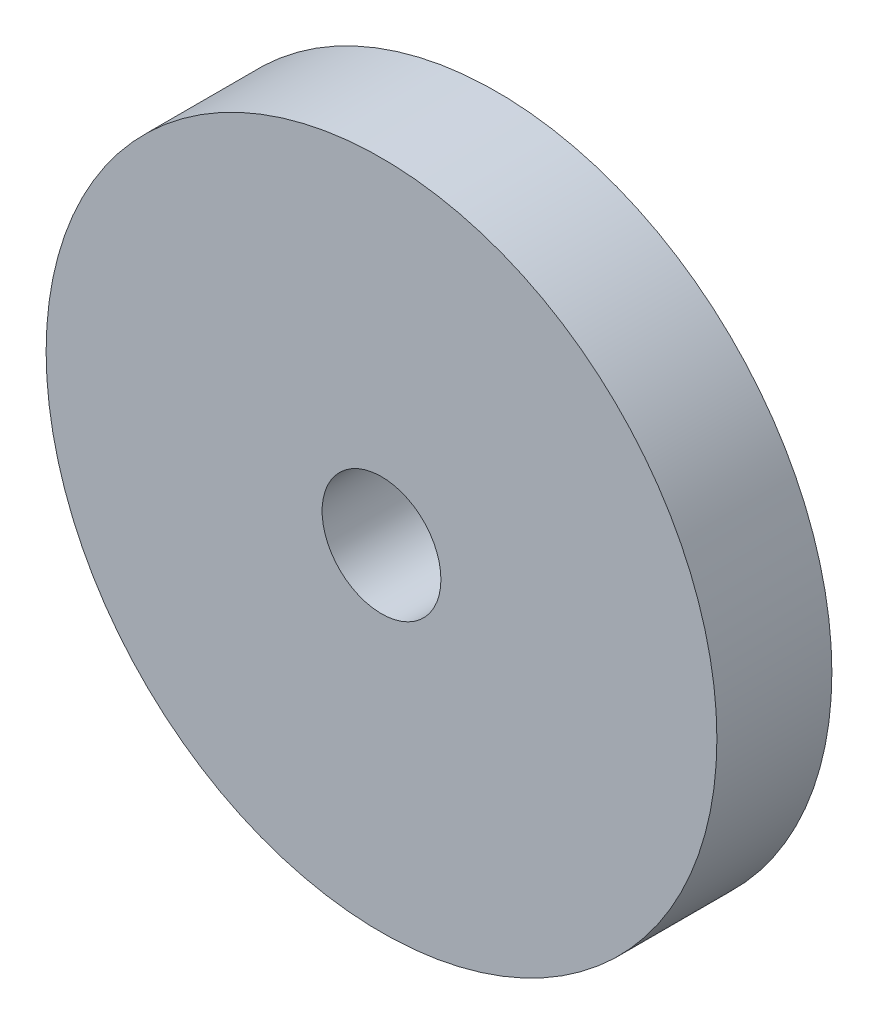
ISO-10303-21;
HEADER;
FILE_DESCRIPTION(('STEP AP214'),'2;1');
FILE_NAME('part.step','',(''),(''),'','','');
FILE_SCHEMA(('AUTOMOTIVE_DESIGN { 1 0 10303 214 1 1 1 1 }'));
ENDSEC;
DATA;
#1=APPLICATION_CONTEXT('core data for automotive mechanical design processes');
#2=APPLICATION_PROTOCOL_DEFINITION('international standard','automotive_design',2000,#1);
#3=PRODUCT_CONTEXT('',#1,'mechanical');
#4=PRODUCT('Part','Part','',(#3));
#5=PRODUCT_RELATED_PRODUCT_CATEGORY('part','',(#4));
#6=PRODUCT_DEFINITION_FORMATION('','',#4);
#7=PRODUCT_DEFINITION_CONTEXT('part definition',#1,'design');
#8=PRODUCT_DEFINITION('design','',#6,#7);
#9=PRODUCT_DEFINITION_SHAPE('','',#8);
#10=(LENGTH_UNIT() NAMED_UNIT(*) SI_UNIT(.MILLI.,.METRE.));
#11=(NAMED_UNIT(*) PLANE_ANGLE_UNIT() SI_UNIT($,.RADIAN.));
#12=(NAMED_UNIT(*) SI_UNIT($,.STERADIAN.) SOLID_ANGLE_UNIT());
#13=UNCERTAINTY_MEASURE_WITH_UNIT(LENGTH_MEASURE(1.E-05),#10,'distance_accuracy_value','');
#14=(GEOMETRIC_REPRESENTATION_CONTEXT(3) GLOBAL_UNCERTAINTY_ASSIGNED_CONTEXT((#13)) GLOBAL_UNIT_ASSIGNED_CONTEXT((#10,
#11,#12)) REPRESENTATION_CONTEXT('',''));
#15=CARTESIAN_POINT('',(0.,0.,0.));
#16=DIRECTION('',(0.,0.,1.));
#17=DIRECTION('',(1.,0.,0.));
#18=AXIS2_PLACEMENT_3D('',#15,#16,#17);
#19=CARTESIAN_POINT('',(0.,0.,6.));
#20=DIRECTION('',(0.,0.,1.));
#21=DIRECTION('',(1.,0.,0.));
#22=AXIS2_PLACEMENT_3D('',#19,#20,#21);
#23=PLANE('',#22);
#24=CARTESIAN_POINT('',(0.,0.,6.));
#25=DIRECTION('',(0.,0.,1.));
#26=DIRECTION('',(1.,0.,0.));
#27=AXIS2_PLACEMENT_3D('',#24,#25,#26);
#28=CIRCLE('',#27,17.5);
#29=CARTESIAN_POINT('',(17.5,0.,6.));
#30=VERTEX_POINT('',#29);
#31=EDGE_CURVE('E10',#30,#30,#28,.T.);
#32=ORIENTED_EDGE('',*,*,#31,.T.);
#33=EDGE_LOOP('',(#32));
#34=FACE_BOUND('',#33,.T.);
#35=CARTESIAN_POINT('',(0.,0.,6.));
#36=DIRECTION('',(0.,0.,1.));
#37=DIRECTION('',(1.,0.,0.));
#38=AXIS2_PLACEMENT_3D('',#35,#36,#37);
#39=CIRCLE('',#38,3.1);
#40=CARTESIAN_POINT('',(3.1,0.,6.));
#41=VERTEX_POINT('',#40);
#42=EDGE_CURVE('E40',#41,#41,#39,.T.);
#43=ORIENTED_EDGE('',*,*,#42,.F.);
#44=EDGE_LOOP('',(#43));
#45=FACE_BOUND('',#44,.T.);
#46=ADVANCED_FACE('F29',(#34,#45),#23,.T.);
#47=CARTESIAN_POINT('',(0.,0.,0.));
#48=DIRECTION('',(0.,0.,1.));
#49=DIRECTION('',(1.,0.,0.));
#50=AXIS2_PLACEMENT_3D('',#47,#48,#49);
#51=PLANE('',#50);
#52=CARTESIAN_POINT('',(0.,0.,0.));
#53=DIRECTION('',(0.,0.,1.));
#54=DIRECTION('',(1.,0.,0.));
#55=AXIS2_PLACEMENT_3D('',#52,#53,#54);
#56=CIRCLE('',#55,17.5);
#57=CARTESIAN_POINT('',(17.5,0.,0.));
#58=VERTEX_POINT('',#57);
#59=EDGE_CURVE('E36',#58,#58,#56,.T.);
#60=ORIENTED_EDGE('',*,*,#59,.F.);
#61=EDGE_LOOP('',(#60));
#62=FACE_BOUND('',#61,.T.);
#63=CARTESIAN_POINT('',(0.,0.,0.));
#64=DIRECTION('',(0.,0.,1.));
#65=DIRECTION('',(1.,0.,0.));
#66=AXIS2_PLACEMENT_3D('',#63,#64,#65);
#67=CIRCLE('',#66,3.1);
#68=CARTESIAN_POINT('',(3.1,0.,0.));
#69=VERTEX_POINT('',#68);
#70=EDGE_CURVE('E44',#69,#69,#67,.T.);
#71=ORIENTED_EDGE('',*,*,#70,.T.);
#72=EDGE_LOOP('',(#71));
#73=FACE_BOUND('',#72,.T.);
#74=ADVANCED_FACE('F50',(#62,#73),#51,.F.);
#75=CARTESIAN_POINT('',(0.,0.,6.));
#76=DIRECTION('',(0.,0.,-1.));
#77=DIRECTION('',(-1.,0.,0.));
#78=AXIS2_PLACEMENT_3D('',#75,#76,#77);
#79=CYLINDRICAL_SURFACE('',#78,17.5);
#80=ORIENTED_EDGE('',*,*,#31,.F.);
#81=EDGE_LOOP('',(#80));
#82=FACE_BOUND('',#81,.T.);
#83=ORIENTED_EDGE('',*,*,#59,.T.);
#84=EDGE_LOOP('',(#83));
#85=FACE_BOUND('',#84,.T.);
#86=ADVANCED_FACE('F31',(#82,#85),#79,.T.);
#87=CARTESIAN_POINT('',(0.,0.,6.));
#88=DIRECTION('',(0.,0.,-1.));
#89=DIRECTION('',(-1.,0.,0.));
#90=AXIS2_PLACEMENT_3D('',#87,#88,#89);
#91=CYLINDRICAL_SURFACE('',#90,3.1);
#92=ORIENTED_EDGE('',*,*,#42,.T.);
#93=EDGE_LOOP('',(#92));
#94=FACE_BOUND('',#93,.T.);
#95=ORIENTED_EDGE('',*,*,#70,.F.);
#96=EDGE_LOOP('',(#95));
#97=FACE_BOUND('',#96,.T.);
#98=ADVANCED_FACE('F52',(#94,#97),#91,.F.);
#99=CLOSED_SHELL('',(#46,#74,#86,#98));
#100=MANIFOLD_SOLID_BREP('B2',#99);
#101=ADVANCED_BREP_SHAPE_REPRESENTATION('',(#18,#100),#14);
#102=SHAPE_DEFINITION_REPRESENTATION(#9,#101);
ENDSEC;
END-ISO-10303-21;
